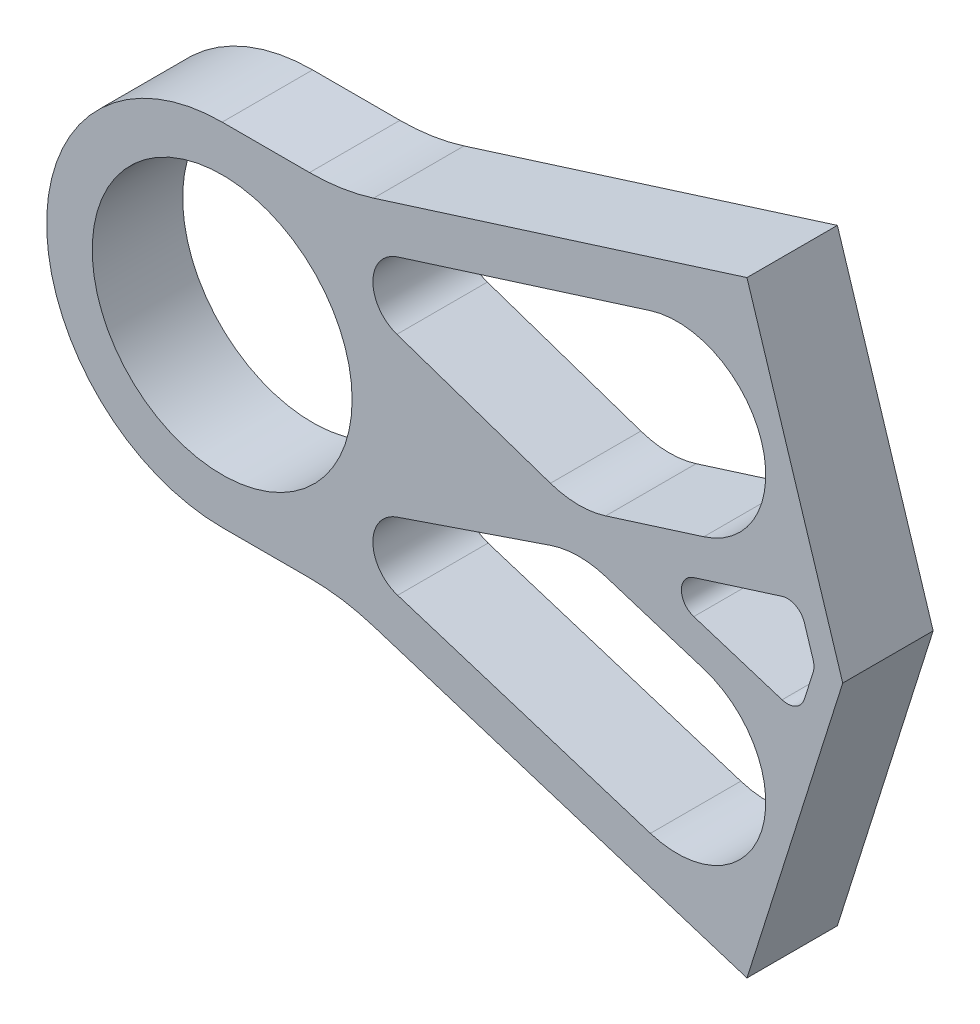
from build123d import *

# Parameters (mm, degrees)
SKETCH1_R          = 9.398
EXTRUDE1_DEPTH     = 3.2385
CUT_EXTRUDE3_DEPTH = 50.897186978
EXTRUDE2_START     = -6.477
EXTRUDE2_DEPTH     = 6.477


with BuildPart() as part:
    # Sketch1 → Extrude1 (new, symmetric)
    with BuildSketch(Plane.XY):
        with BuildLine():
            Line((0, 12.573), (6.25746459, 12.573))
            ThreePointArc((6.25746459, 12.573), (8.579015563, 12.750862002), (10.846378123, 13.280296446))
            Line((10.846378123, 13.280296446), (37.590016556, 21.724991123))
            Line((37.590016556, 21.724991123), (44.45, 0))
            Line((44.45, 0), (37.590016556, -21.724991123))
            Line((37.590016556, -21.724991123), (10.846378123, -13.280296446))
            ThreePointArc((10.846378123, -13.280296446), (8.579015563, -12.750862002), (6.25746459, -12.573))
            Line((6.25746459, -12.573), (0, -12.573))
            ThreePointArc((0, -12.573), (-12.573, 0), (0, 12.573))
        make_face()
        Circle(SKETCH1_R, mode=Mode.SUBTRACT)
    extrude(amount=EXTRUDE1_DEPTH, both=True)

    # Sketch9 → Cut-Extrude3 (cut, through all)
    with BuildSketch(Plane(origin=(0, 0, 3.2385), x_dir=(-1, 0, 0), z_dir=(0, 0, -1))):
        with BuildLine():
            Line((-23.647121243, -13.992793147), (-30.674159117, -16.211683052))
            ThreePointArc((-30.674159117, -16.211683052), (-38.64149957, -12.06843721), (-34.498253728, -4.101096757))
            Line((-34.498253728, -4.101096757), (-27.471215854, -1.882206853))
            ThreePointArc((-27.471215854, -1.882206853), (-25.48889796, -1.587888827), (-23.513579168, -1.926005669))
            Line((-23.513579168, -1.926005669), (-12.516194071, -5.668192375))
            ThreePointArc((-12.516194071, -5.668192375), (-10.794585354, -8.100898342), (-12.569610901, -10.494907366))
            Line((-12.569610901, -10.494907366), (-23.647121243, -13.992793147))
        make_face()
        with BuildLine():
            Line((-23.647121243, 13.992793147), (-12.569610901, 10.494907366))
            ThreePointArc((-12.569610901, 10.494907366), (-10.794585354, 8.100898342), (-12.516194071, 5.668192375))
            Line((-12.516194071, 5.668192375), (-23.513579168, 1.926005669))
            ThreePointArc((-23.513579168, 1.926005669), (-25.48889796, 1.587888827), (-27.471215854, 1.882206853))
            Line((-27.471215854, 1.882206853), (-34.498253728, 4.101096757))
            ThreePointArc((-34.498253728, 4.101096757), (-38.64149957, 12.06843721), (-30.674159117, 16.211683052))
            Line((-30.674159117, 16.211683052), (-23.647121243, 13.992793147))
        make_face()
        with BuildLine():
            Line((-33.781206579, -1.211058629), (-40.107307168, -3.208617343))
            ThreePointArc((-40.107307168, -3.208617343), (-41.075660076, -3.124310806), (-41.700775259, -2.379968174))
            Line((-41.700775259, -2.379968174), (-42.331533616, -0.382409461))
            ThreePointArc((-42.331533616, -0.382409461), (-42.390474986, 0), (-42.331533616, 0.382409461))
            Line((-42.331533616, 0.382409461), (-41.700775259, 2.379968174))
            ThreePointArc((-41.700775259, 2.379968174), (-41.075660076, 3.124310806), (-40.107307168, 3.208617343))
            Line((-40.107307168, 3.208617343), (-33.781206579, 1.211058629))
            ThreePointArc((-33.781206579, 1.211058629), (-32.89361604, 0), (-33.781206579, -1.211058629))
        make_face()
    extrude(amount=CUT_EXTRUDE3_DEPTH, mode=Mode.SUBTRACT)

    # Sketch10 → Extrude2 (add)
    with BuildSketch(Plane.XY.offset(3.2385).offset(EXTRUDE2_START)):
        with BuildLine():
            ThreePointArc((0, 9.398), (-9.398, 0), (0, -9.398))
            ThreePointArc((0, -9.398), (9.398, 0), (0, 9.398))
        make_face()
        with BuildLine():
            ThreePointArc((0, -9.3091), (9.3091, 0), (0, 9.3091))
            ThreePointArc((0, 9.3091), (-9.3091, 0), (0, -9.3091))
        make_face(mode=Mode.SUBTRACT)
    extrude(amount=EXTRUDE2_DEPTH)


solid = part.part
